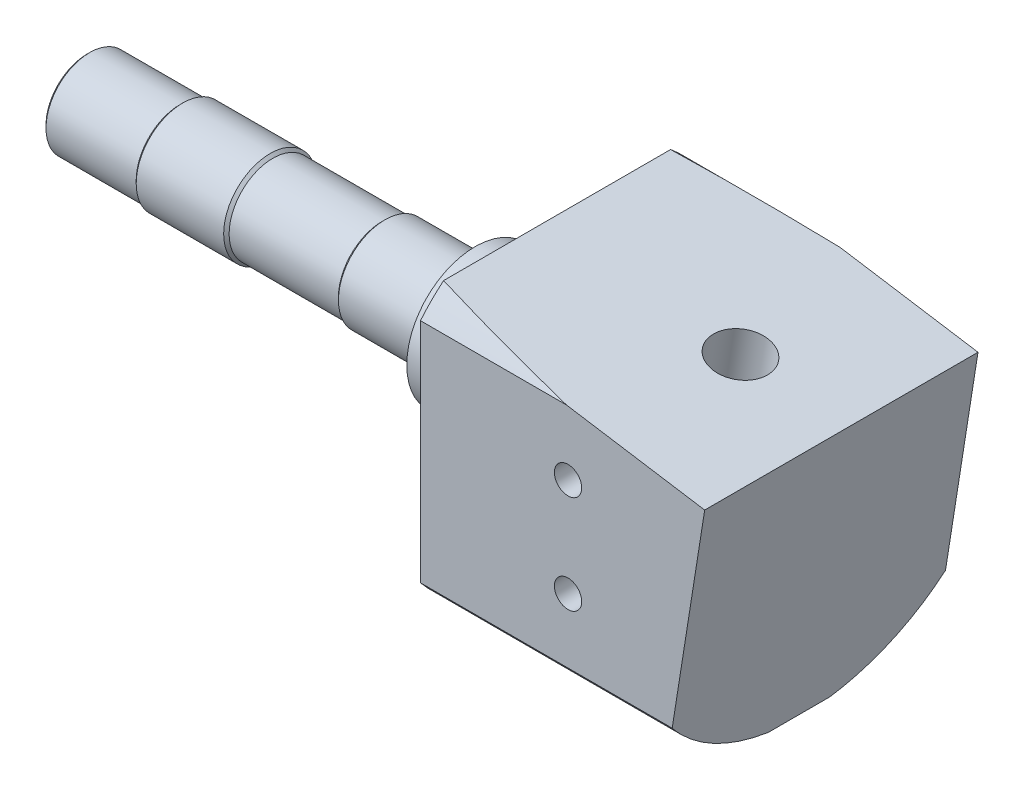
ISO-10303-21;
HEADER;
FILE_DESCRIPTION(('STEP AP214'),'2;1');
FILE_NAME('part.step','',(''),(''),'','','');
FILE_SCHEMA(('AUTOMOTIVE_DESIGN { 1 0 10303 214 1 1 1 1 }'));
ENDSEC;
DATA;
#1=APPLICATION_CONTEXT('core data for automotive mechanical design processes');
#2=APPLICATION_PROTOCOL_DEFINITION('international standard','automotive_design',2000,#1);
#3=PRODUCT_CONTEXT('',#1,'mechanical');
#4=PRODUCT('Part','Part','',(#3));
#5=PRODUCT_RELATED_PRODUCT_CATEGORY('part','',(#4));
#6=PRODUCT_DEFINITION_FORMATION('','',#4);
#7=PRODUCT_DEFINITION_CONTEXT('part definition',#1,'design');
#8=PRODUCT_DEFINITION('design','',#6,#7);
#9=PRODUCT_DEFINITION_SHAPE('','',#8);
#10=(LENGTH_UNIT() NAMED_UNIT(*) SI_UNIT(.MILLI.,.METRE.));
#11=(NAMED_UNIT(*) PLANE_ANGLE_UNIT() SI_UNIT($,.RADIAN.));
#12=(NAMED_UNIT(*) SI_UNIT($,.STERADIAN.) SOLID_ANGLE_UNIT());
#13=UNCERTAINTY_MEASURE_WITH_UNIT(LENGTH_MEASURE(1.E-05),#10,'distance_accuracy_value','');
#14=(GEOMETRIC_REPRESENTATION_CONTEXT(3) GLOBAL_UNCERTAINTY_ASSIGNED_CONTEXT((#13)) GLOBAL_UNIT_ASSIGNED_CONTEXT((#10,
#11,#12)) REPRESENTATION_CONTEXT('',''));
#15=CARTESIAN_POINT('',(0.,0.,0.));
#16=DIRECTION('',(0.,0.,1.));
#17=DIRECTION('',(1.,0.,0.));
#18=AXIS2_PLACEMENT_3D('',#15,#16,#17);
#19=CARTESIAN_POINT('',(86.,25.,25.));
#20=DIRECTION('',(1.,0.,0.));
#21=DIRECTION('',(0.,1.,0.));
#22=AXIS2_PLACEMENT_3D('',#19,#20,#21);
#23=PLANE('',#22);
#24=CARTESIAN_POINT('',(86.,0.,0.));
#25=DIRECTION('',(1.,0.,0.));
#26=DIRECTION('',(0.,1.,0.));
#27=AXIS2_PLACEMENT_3D('',#24,#25,#26);
#28=CIRCLE('',#27,12.5);
#29=CARTESIAN_POINT('',(86.,12.5,0.));
#30=VERTEX_POINT('',#29);
#31=EDGE_CURVE('E124',#30,#30,#28,.T.);
#32=ORIENTED_EDGE('',*,*,#31,.T.);
#33=EDGE_LOOP('',(#32));
#34=FACE_BOUND('',#33,.T.);
#35=CARTESIAN_POINT('',(86.,0.,0.));
#36=DIRECTION('',(-1.,0.,0.));
#37=DIRECTION('',(0.,-1.,0.));
#38=AXIS2_PLACEMENT_3D('',#35,#36,#37);
#39=CIRCLE('',#38,32.5);
#40=CARTESIAN_POINT('',(86.,20.7665596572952,25.));
#41=VERTEX_POINT('',#40);
#42=CARTESIAN_POINT('',(86.,25.,20.7665596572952));
#43=VERTEX_POINT('',#42);
#44=EDGE_CURVE('E56',#41,#43,#39,.T.);
#45=ORIENTED_EDGE('',*,*,#44,.T.);
#46=DIRECTION('',(0.,0.,-1.));
#47=VECTOR('',#46,1.);
#48=CARTESIAN_POINT('',(86.,25.,25.));
#49=LINE('',#48,#47);
#50=CARTESIAN_POINT('',(86.,25.,-20.7665596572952));
#51=VERTEX_POINT('',#50);
#52=EDGE_CURVE('E121',#43,#51,#49,.T.);
#53=ORIENTED_EDGE('',*,*,#52,.T.);
#54=CARTESIAN_POINT('',(86.,20.7665596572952,-25.));
#55=VERTEX_POINT('',#54);
#56=EDGE_CURVE('E206',#51,#55,#39,.T.);
#57=ORIENTED_EDGE('',*,*,#56,.T.);
#58=DIRECTION('',(0.,-1.,0.));
#59=VECTOR('',#58,1.);
#60=CARTESIAN_POINT('',(86.,25.,-25.));
#61=LINE('',#60,#59);
#62=CARTESIAN_POINT('',(86.,-20.7665596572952,-25.));
#63=VERTEX_POINT('',#62);
#64=EDGE_CURVE('E169',#55,#63,#61,.T.);
#65=ORIENTED_EDGE('',*,*,#64,.T.);
#66=CARTESIAN_POINT('',(86.,-25.,-20.7665596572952));
#67=VERTEX_POINT('',#66);
#68=EDGE_CURVE('E107',#63,#67,#39,.T.);
#69=ORIENTED_EDGE('',*,*,#68,.T.);
#70=DIRECTION('',(0.,0.,-1.));
#71=VECTOR('',#70,1.);
#72=CARTESIAN_POINT('',(86.,-25.,25.));
#73=LINE('',#72,#71);
#74=CARTESIAN_POINT('',(86.,-25.,20.7665596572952));
#75=VERTEX_POINT('',#74);
#76=EDGE_CURVE('E113',#75,#67,#73,.T.);
#77=ORIENTED_EDGE('',*,*,#76,.F.);
#78=CARTESIAN_POINT('',(86.,-20.7665596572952,25.));
#79=VERTEX_POINT('',#78);
#80=EDGE_CURVE('E96',#75,#79,#39,.T.);
#81=ORIENTED_EDGE('',*,*,#80,.T.);
#82=DIRECTION('',(0.,-1.,0.));
#83=VECTOR('',#82,1.);
#84=CARTESIAN_POINT('',(86.,25.,25.));
#85=LINE('',#84,#83);
#86=EDGE_CURVE('E189',#41,#79,#85,.T.);
#87=ORIENTED_EDGE('',*,*,#86,.F.);
#88=EDGE_LOOP('',(#45,#53,#57,#65,#69,#77,#81,#87));
#89=FACE_BOUND('',#88,.T.);
#90=ADVANCED_FACE('F32',(#34,#89),#23,.F.);
#91=CARTESIAN_POINT('',(86.,25.,25.));
#92=DIRECTION('',(-0.156434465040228,-0.987688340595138,0.));
#93=DIRECTION('',(0.987688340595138,-0.156434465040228,0.));
#94=AXIS2_PLACEMENT_3D('',#91,#92,#93);
#95=PLANE('',#94);
#96=CARTESIAN_POINT('',(119.551441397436,19.6859737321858,0.));
#97=DIRECTION('',(0.156434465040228,0.987688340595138,0.));
#98=DIRECTION('',(-0.987688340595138,0.156434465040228,0.));
#99=AXIS2_PLACEMENT_3D('',#96,#97,#98);
#100=CIRCLE('',#99,4.99999999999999);
#101=CARTESIAN_POINT('',(114.61299969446,20.4681460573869,0.));
#102=VERTEX_POINT('',#101);
#103=EDGE_CURVE('E208',#102,#102,#100,.T.);
#104=ORIENTED_EDGE('',*,*,#103,.F.);
#105=EDGE_LOOP('',(#104));
#106=FACE_BOUND('',#105,.T.);
#107=CARTESIAN_POINT('',(243.843787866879,0.,0.));
#108=DIRECTION('',(-0.156434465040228,-0.987688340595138,0.));
#109=DIRECTION('',(-0.987688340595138,0.156434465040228,0.));
#110=AXIS2_PLACEMENT_3D('',#107,#108,#109);
#111=ELLIPSE('',#110,207.754729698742,32.5);
#112=CARTESIAN_POINT('',(112.728890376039,20.7665596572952,-25.));
#113=VERTEX_POINT('',#112);
#114=EDGE_CURVE('E105',#51,#113,#111,.T.);
#115=ORIENTED_EDGE('',*,*,#114,.F.);
#116=ORIENTED_EDGE('',*,*,#52,.F.);
#117=CARTESIAN_POINT('',(112.728890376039,20.7665596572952,25.));
#118=VERTEX_POINT('',#117);
#119=EDGE_CURVE('E199',#118,#43,#111,.T.);
#120=ORIENTED_EDGE('',*,*,#119,.F.);
#121=DIRECTION('',(-0.987688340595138,0.156434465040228,0.));
#122=VECTOR('',#121,1.);
#123=CARTESIAN_POINT('',(86.,25.,25.));
#124=LINE('',#123,#122);
#125=CARTESIAN_POINT('',(138.,16.7640091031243,25.));
#126=VERTEX_POINT('',#125);
#127=EDGE_CURVE('E186',#126,#118,#124,.T.);
#128=ORIENTED_EDGE('',*,*,#127,.F.);
#129=DIRECTION('',(0.,0.,-1.));
#130=VECTOR('',#129,1.);
#131=CARTESIAN_POINT('',(138.,16.7640091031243,25.));
#132=LINE('',#131,#130);
#133=CARTESIAN_POINT('',(138.,16.7640091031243,-25.));
#134=VERTEX_POINT('',#133);
#135=EDGE_CURVE('E126',#126,#134,#132,.T.);
#136=ORIENTED_EDGE('',*,*,#135,.T.);
#137=DIRECTION('',(-0.987688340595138,0.156434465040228,0.));
#138=VECTOR('',#137,1.);
#139=CARTESIAN_POINT('',(86.,25.,-25.));
#140=LINE('',#139,#138);
#141=EDGE_CURVE('E116',#134,#113,#140,.T.);
#142=ORIENTED_EDGE('',*,*,#141,.T.);
#143=EDGE_LOOP('',(#115,#116,#120,#128,#136,#142));
#144=FACE_BOUND('',#143,.T.);
#145=ADVANCED_FACE('F175',(#106,#144),#95,.F.);
#146=CARTESIAN_POINT('',(86.,-25.,25.));
#147=DIRECTION('',(0.156434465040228,0.987688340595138,0.));
#148=DIRECTION('',(-0.987688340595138,0.156434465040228,0.));
#149=AXIS2_PLACEMENT_3D('',#146,#147,#148);
#150=PLANE('',#149);
#151=CARTESIAN_POINT('',(111.826016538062,-29.0904391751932,0.));
#152=DIRECTION('',(0.156434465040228,0.987688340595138,0.));
#153=DIRECTION('',(-0.987688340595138,0.156434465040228,0.));
#154=AXIS2_PLACEMENT_3D('',#151,#152,#153);
#155=CIRCLE('',#154,4.99999999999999);
#156=CARTESIAN_POINT('',(106.887574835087,-28.308266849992,0.));
#157=VERTEX_POINT('',#156);
#158=EDGE_CURVE('E36',#157,#157,#155,.T.);
#159=ORIENTED_EDGE('',*,*,#158,.T.);
#160=EDGE_LOOP('',(#159));
#161=FACE_BOUND('',#160,.T.);
#162=CARTESIAN_POINT('',(-71.8437878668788,0.,0.));
#163=DIRECTION('',(0.156434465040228,0.987688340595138,0.));
#164=DIRECTION('',(-0.987688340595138,0.156434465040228,0.));
#165=AXIS2_PLACEMENT_3D('',#162,#163,#164);
#166=ELLIPSE('',#165,207.754729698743,32.5);
#167=CARTESIAN_POINT('',(130.274575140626,-32.0124038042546,5.60856511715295));
#168=VERTEX_POINT('',#167);
#169=EDGE_CURVE('E99',#75,#168,#166,.T.);
#170=ORIENTED_EDGE('',*,*,#169,.F.);
#171=ORIENTED_EDGE('',*,*,#76,.T.);
#172=CARTESIAN_POINT('',(130.274575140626,-32.0124038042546,-5.60856511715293));
#173=VERTEX_POINT('',#172);
#174=EDGE_CURVE('E118',#173,#67,#166,.T.);
#175=ORIENTED_EDGE('',*,*,#174,.F.);
#176=DIRECTION('',(0.,0.,-1.));
#177=VECTOR('',#176,1.);
#178=CARTESIAN_POINT('',(130.274575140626,-32.0124038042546,25.));
#179=LINE('',#178,#177);
#180=EDGE_CURVE('E115',#168,#173,#179,.T.);
#181=ORIENTED_EDGE('',*,*,#180,.F.);
#182=EDGE_LOOP('',(#170,#171,#175,#181));
#183=FACE_BOUND('',#182,.T.);
#184=ADVANCED_FACE('F111',(#161,#183),#150,.F.);
#185=CARTESIAN_POINT('',(138.,16.7640091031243,25.));
#186=DIRECTION('',(-0.987688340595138,0.156434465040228,0.));
#187=DIRECTION('',(-0.156434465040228,-0.987688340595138,0.));
#188=AXIS2_PLACEMENT_3D('',#185,#186,#187);
#189=PLANE('',#188);
#190=CARTESIAN_POINT('',(135.344841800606,0.,0.));
#191=DIRECTION('',(-0.987688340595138,0.156434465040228,0.));
#192=DIRECTION('',(-0.156434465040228,-0.987688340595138,0.));
#193=AXIS2_PLACEMENT_3D('',#190,#191,#192);
#194=ELLIPSE('',#193,32.9051165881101,32.5);
#195=CARTESIAN_POINT('',(132.05574187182,-20.7665596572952,25.));
#196=VERTEX_POINT('',#195);
#197=EDGE_CURVE('E48',#168,#196,#194,.T.);
#198=ORIENTED_EDGE('',*,*,#197,.F.);
#199=ORIENTED_EDGE('',*,*,#180,.T.);
#200=CARTESIAN_POINT('',(132.05574187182,-20.7665596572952,-25.));
#201=VERTEX_POINT('',#200);
#202=EDGE_CURVE('E203',#201,#173,#194,.T.);
#203=ORIENTED_EDGE('',*,*,#202,.F.);
#204=DIRECTION('',(0.156434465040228,0.987688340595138,0.));
#205=VECTOR('',#204,1.);
#206=CARTESIAN_POINT('',(138.,16.7640091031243,-25.));
#207=LINE('',#206,#205);
#208=EDGE_CURVE('E180',#201,#134,#207,.T.);
#209=ORIENTED_EDGE('',*,*,#208,.T.);
#210=ORIENTED_EDGE('',*,*,#135,.F.);
#211=DIRECTION('',(0.156434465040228,0.987688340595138,0.));
#212=VECTOR('',#211,1.);
#213=CARTESIAN_POINT('',(138.,16.7640091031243,25.));
#214=LINE('',#213,#212);
#215=EDGE_CURVE('E191',#196,#126,#214,.T.);
#216=ORIENTED_EDGE('',*,*,#215,.F.);
#217=EDGE_LOOP('',(#198,#199,#203,#209,#210,#216));
#218=FACE_BOUND('',#217,.T.);
#219=ADVANCED_FACE('F196',(#218),#189,.F.);
#220=CARTESIAN_POINT('',(138.,16.7640091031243,25.));
#221=DIRECTION('',(0.,0.,-1.));
#222=DIRECTION('',(-1.,0.,0.));
#223=AXIS2_PLACEMENT_3D('',#220,#221,#222);
#224=PLANE('',#223);
#225=CARTESIAN_POINT('',(113.,-9.,25.));
#226=DIRECTION('',(0.,0.,1.));
#227=DIRECTION('',(1.,0.,0.));
#228=AXIS2_PLACEMENT_3D('',#225,#226,#227);
#229=CIRCLE('',#228,2.5);
#230=CARTESIAN_POINT('',(115.5,-9.,25.));
#231=VERTEX_POINT('',#230);
#232=EDGE_CURVE('E220',#231,#231,#229,.T.);
#233=ORIENTED_EDGE('',*,*,#232,.F.);
#234=EDGE_LOOP('',(#233));
#235=FACE_BOUND('',#234,.T.);
#236=CARTESIAN_POINT('',(113.,9.,25.));
#237=DIRECTION('',(0.,0.,1.));
#238=DIRECTION('',(1.,0.,0.));
#239=AXIS2_PLACEMENT_3D('',#236,#237,#238);
#240=CIRCLE('',#239,2.5);
#241=CARTESIAN_POINT('',(115.5,9.,25.));
#242=VERTEX_POINT('',#241);
#243=EDGE_CURVE('E214',#242,#242,#240,.T.);
#244=ORIENTED_EDGE('',*,*,#243,.F.);
#245=EDGE_LOOP('',(#244));
#246=FACE_BOUND('',#245,.T.);
#247=DIRECTION('',(-1.,0.,0.));
#248=VECTOR('',#247,1.);
#249=CARTESIAN_POINT('',(138.,-20.7665596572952,25.));
#250=LINE('',#249,#248);
#251=EDGE_CURVE('E100',#196,#79,#250,.T.);
#252=ORIENTED_EDGE('',*,*,#251,.F.);
#253=ORIENTED_EDGE('',*,*,#215,.T.);
#254=ORIENTED_EDGE('',*,*,#127,.T.);
#255=DIRECTION('',(-1.,0.,0.));
#256=VECTOR('',#255,1.);
#257=CARTESIAN_POINT('',(138.,20.7665596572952,25.));
#258=LINE('',#257,#256);
#259=EDGE_CURVE('E200',#41,#118,#258,.F.);
#260=ORIENTED_EDGE('',*,*,#259,.F.);
#261=ORIENTED_EDGE('',*,*,#86,.T.);
#262=EDGE_LOOP('',(#252,#253,#254,#260,#261));
#263=FACE_BOUND('',#262,.T.);
#264=ADVANCED_FACE('F194',(#235,#246,#263),#224,.F.);
#265=CARTESIAN_POINT('',(138.,16.7640091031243,-25.));
#266=DIRECTION('',(0.,0.,-1.));
#267=DIRECTION('',(-1.,0.,0.));
#268=AXIS2_PLACEMENT_3D('',#265,#266,#267);
#269=PLANE('',#268);
#270=ORIENTED_EDGE('',*,*,#208,.F.);
#271=DIRECTION('',(-1.,0.,0.));
#272=VECTOR('',#271,1.);
#273=CARTESIAN_POINT('',(138.,-20.7665596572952,-25.));
#274=LINE('',#273,#272);
#275=EDGE_CURVE('E11',#201,#63,#274,.T.);
#276=ORIENTED_EDGE('',*,*,#275,.T.);
#277=ORIENTED_EDGE('',*,*,#64,.F.);
#278=DIRECTION('',(-1.,0.,0.));
#279=VECTOR('',#278,1.);
#280=CARTESIAN_POINT('',(138.,20.7665596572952,-25.));
#281=LINE('',#280,#279);
#282=EDGE_CURVE('E41',#55,#113,#281,.F.);
#283=ORIENTED_EDGE('',*,*,#282,.T.);
#284=ORIENTED_EDGE('',*,*,#141,.F.);
#285=EDGE_LOOP('',(#270,#276,#277,#283,#284));
#286=FACE_BOUND('',#285,.T.);
#287=ADVANCED_FACE('F168',(#286),#269,.T.);
#288=CARTESIAN_POINT('',(0.,0.,0.));
#289=DIRECTION('',(1.,0.,0.));
#290=DIRECTION('',(0.,0.,-1.));
#291=AXIS2_PLACEMENT_3D('',#288,#289,#290);
#292=PLANE('',#291);
#293=CARTESIAN_POINT('',(0.,0.,0.));
#294=DIRECTION('',(1.,0.,0.));
#295=DIRECTION('',(0.,0.,-1.));
#296=AXIS2_PLACEMENT_3D('',#293,#294,#295);
#297=CIRCLE('',#296,7.5);
#298=CARTESIAN_POINT('',(0.,0.,-7.5));
#299=VERTEX_POINT('',#298);
#300=EDGE_CURVE('E147',#299,#299,#297,.F.);
#301=ORIENTED_EDGE('',*,*,#300,.T.);
#302=EDGE_LOOP('',(#301));
#303=FACE_BOUND('',#302,.T.);
#304=ADVANCED_FACE('F34',(#303),#292,.F.);
#305=CARTESIAN_POINT('',(-24.7781284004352,0.,0.));
#306=DIRECTION('',(-1.,0.,0.));
#307=DIRECTION('',(0.,0.,1.));
#308=AXIS2_PLACEMENT_3D('',#305,#306,#307);
#309=CYLINDRICAL_SURFACE('',#308,8.);
#310=CARTESIAN_POINT('',(0.5,0.,0.));
#311=DIRECTION('',(1.,0.,0.));
#312=DIRECTION('',(0.,0.,-1.));
#313=AXIS2_PLACEMENT_3D('',#310,#311,#312);
#314=CIRCLE('',#313,8.);
#315=CARTESIAN_POINT('',(0.5,0.,-8.));
#316=VERTEX_POINT('',#315);
#317=EDGE_CURVE('E150',#316,#316,#314,.T.);
#318=ORIENTED_EDGE('',*,*,#317,.T.);
#319=EDGE_LOOP('',(#318));
#320=FACE_BOUND('',#319,.T.);
#321=CARTESIAN_POINT('',(17.,0.,0.));
#322=DIRECTION('',(-1.,0.,0.));
#323=DIRECTION('',(0.,0.,1.));
#324=AXIS2_PLACEMENT_3D('',#321,#322,#323);
#325=CIRCLE('',#324,8.);
#326=CARTESIAN_POINT('',(17.,0.,8.));
#327=VERTEX_POINT('',#326);
#328=EDGE_CURVE('E144',#327,#327,#325,.T.);
#329=ORIENTED_EDGE('',*,*,#328,.T.);
#330=EDGE_LOOP('',(#329));
#331=FACE_BOUND('',#330,.T.);
#332=ADVANCED_FACE('F292',(#320,#331),#309,.T.);
#333=CARTESIAN_POINT('',(-24.7781284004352,0.,0.));
#334=DIRECTION('',(-1.,0.,0.));
#335=DIRECTION('',(0.,0.,1.));
#336=AXIS2_PLACEMENT_3D('',#333,#334,#335);
#337=CYLINDRICAL_SURFACE('',#336,8.5);
#338=CARTESIAN_POINT('',(17.5,0.,0.));
#339=DIRECTION('',(1.,0.,0.));
#340=DIRECTION('',(0.,0.,-1.));
#341=AXIS2_PLACEMENT_3D('',#338,#339,#340);
#342=CIRCLE('',#341,8.5);
#343=CARTESIAN_POINT('',(17.5,0.,-8.5));
#344=VERTEX_POINT('',#343);
#345=EDGE_CURVE('E156',#344,#344,#342,.T.);
#346=ORIENTED_EDGE('',*,*,#345,.T.);
#347=EDGE_LOOP('',(#346));
#348=FACE_BOUND('',#347,.T.);
#349=CARTESIAN_POINT('',(33.5,0.,0.));
#350=DIRECTION('',(-1.,0.,0.));
#351=DIRECTION('',(0.,0.,1.));
#352=AXIS2_PLACEMENT_3D('',#349,#350,#351);
#353=CIRCLE('',#352,8.5);
#354=CARTESIAN_POINT('',(33.5,0.,8.5));
#355=VERTEX_POINT('',#354);
#356=EDGE_CURVE('E153',#355,#355,#353,.T.);
#357=ORIENTED_EDGE('',*,*,#356,.T.);
#358=EDGE_LOOP('',(#357));
#359=FACE_BOUND('',#358,.T.);
#360=ADVANCED_FACE('F289',(#348,#359),#337,.T.);
#361=CARTESIAN_POINT('',(-24.7781284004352,0.,0.));
#362=DIRECTION('',(-1.,0.,0.));
#363=DIRECTION('',(0.,0.,1.));
#364=AXIS2_PLACEMENT_3D('',#361,#362,#363);
#365=CYLINDRICAL_SURFACE('',#364,8.);
#366=CARTESIAN_POINT('',(34.,0.,0.));
#367=DIRECTION('',(-1.,0.,0.));
#368=DIRECTION('',(0.,0.,1.));
#369=AXIS2_PLACEMENT_3D('',#366,#367,#368);
#370=CIRCLE('',#369,8.);
#371=CARTESIAN_POINT('',(34.,0.,8.));
#372=VERTEX_POINT('',#371);
#373=EDGE_CURVE('E141',#372,#372,#370,.T.);
#374=ORIENTED_EDGE('',*,*,#373,.F.);
#375=EDGE_LOOP('',(#374));
#376=FACE_BOUND('',#375,.T.);
#377=CARTESIAN_POINT('',(54.,0.,0.));
#378=DIRECTION('',(-1.,0.,0.));
#379=DIRECTION('',(0.,0.,1.));
#380=AXIS2_PLACEMENT_3D('',#377,#378,#379);
#381=CIRCLE('',#380,8.);
#382=CARTESIAN_POINT('',(54.,0.,8.));
#383=VERTEX_POINT('',#382);
#384=EDGE_CURVE('E138',#383,#383,#381,.T.);
#385=ORIENTED_EDGE('',*,*,#384,.T.);
#386=EDGE_LOOP('',(#385));
#387=FACE_BOUND('',#386,.T.);
#388=ADVANCED_FACE('F285',(#376,#387),#365,.T.);
#389=CARTESIAN_POINT('',(-24.7781284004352,0.,0.));
#390=DIRECTION('',(-1.,0.,0.));
#391=DIRECTION('',(0.,0.,1.));
#392=AXIS2_PLACEMENT_3D('',#389,#390,#391);
#393=CYLINDRICAL_SURFACE('',#392,8.5);
#394=CARTESIAN_POINT('',(54.5,0.,0.));
#395=DIRECTION('',(1.,0.,0.));
#396=DIRECTION('',(0.,0.,-1.));
#397=AXIS2_PLACEMENT_3D('',#394,#395,#396);
#398=CIRCLE('',#397,8.5);
#399=CARTESIAN_POINT('',(54.5,0.,-8.5));
#400=VERTEX_POINT('',#399);
#401=EDGE_CURVE('E159',#400,#400,#398,.T.);
#402=ORIENTED_EDGE('',*,*,#401,.T.);
#403=EDGE_LOOP('',(#402));
#404=FACE_BOUND('',#403,.T.);
#405=CARTESIAN_POINT('',(71.,0.,0.));
#406=DIRECTION('',(-1.,0.,0.));
#407=DIRECTION('',(0.,0.,1.));
#408=AXIS2_PLACEMENT_3D('',#405,#406,#407);
#409=CIRCLE('',#408,8.5);
#410=CARTESIAN_POINT('',(71.,0.,8.5));
#411=VERTEX_POINT('',#410);
#412=EDGE_CURVE('E135',#411,#411,#409,.T.);
#413=ORIENTED_EDGE('',*,*,#412,.T.);
#414=EDGE_LOOP('',(#413));
#415=FACE_BOUND('',#414,.T.);
#416=ADVANCED_FACE('F281',(#404,#415),#393,.T.);
#417=CARTESIAN_POINT('',(71.,8.5,0.));
#418=DIRECTION('',(1.,0.,0.));
#419=DIRECTION('',(0.,0.,-1.));
#420=AXIS2_PLACEMENT_3D('',#417,#418,#419);
#421=PLANE('',#420);
#422=ORIENTED_EDGE('',*,*,#412,.F.);
#423=EDGE_LOOP('',(#422));
#424=FACE_BOUND('',#423,.T.);
#425=CARTESIAN_POINT('',(71.,0.,0.));
#426=DIRECTION('',(-1.,0.,0.));
#427=DIRECTION('',(0.,0.,1.));
#428=AXIS2_PLACEMENT_3D('',#425,#426,#427);
#429=CIRCLE('',#428,12.5);
#430=CARTESIAN_POINT('',(71.,0.,12.5));
#431=VERTEX_POINT('',#430);
#432=EDGE_CURVE('E132',#431,#431,#429,.T.);
#433=ORIENTED_EDGE('',*,*,#432,.T.);
#434=EDGE_LOOP('',(#433));
#435=FACE_BOUND('',#434,.T.);
#436=ADVANCED_FACE('F277',(#424,#435),#421,.F.);
#437=CARTESIAN_POINT('',(-24.7781284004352,0.,0.));
#438=DIRECTION('',(-1.,0.,0.));
#439=DIRECTION('',(0.,0.,1.));
#440=AXIS2_PLACEMENT_3D('',#437,#438,#439);
#441=CYLINDRICAL_SURFACE('',#440,12.5);
#442=ORIENTED_EDGE('',*,*,#432,.F.);
#443=EDGE_LOOP('',(#442));
#444=FACE_BOUND('',#443,.T.);
#445=ORIENTED_EDGE('',*,*,#31,.F.);
#446=EDGE_LOOP('',(#445));
#447=FACE_BOUND('',#446,.T.);
#448=ADVANCED_FACE('F273',(#444,#447),#441,.T.);
#449=CARTESIAN_POINT('',(0.,0.,0.));
#450=DIRECTION('',(1.,0.,0.));
#451=DIRECTION('',(0.,0.,-1.));
#452=AXIS2_PLACEMENT_3D('',#449,#450,#451);
#453=CONICAL_SURFACE('',#452,7.5,0.785398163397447);
#454=ORIENTED_EDGE('',*,*,#317,.F.);
#455=EDGE_LOOP('',(#454));
#456=FACE_BOUND('',#455,.T.);
#457=ORIENTED_EDGE('',*,*,#300,.F.);
#458=EDGE_LOOP('',(#457));
#459=FACE_BOUND('',#458,.T.);
#460=ADVANCED_FACE('F269',(#456,#459),#453,.T.);
#461=CARTESIAN_POINT('',(17.,0.,0.));
#462=DIRECTION('',(1.,0.,0.));
#463=DIRECTION('',(0.,0.,-1.));
#464=AXIS2_PLACEMENT_3D('',#461,#462,#463);
#465=CONICAL_SURFACE('',#464,8.00000000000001,0.78539816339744);
#466=ORIENTED_EDGE('',*,*,#345,.F.);
#467=EDGE_LOOP('',(#466));
#468=FACE_BOUND('',#467,.T.);
#469=ORIENTED_EDGE('',*,*,#328,.F.);
#470=EDGE_LOOP('',(#469));
#471=FACE_BOUND('',#470,.T.);
#472=ADVANCED_FACE('F265',(#468,#471),#465,.T.);
#473=CARTESIAN_POINT('',(33.5,0.,0.));
#474=DIRECTION('',(-1.,0.,0.));
#475=DIRECTION('',(0.,0.,1.));
#476=AXIS2_PLACEMENT_3D('',#473,#474,#475);
#477=CONICAL_SURFACE('',#476,8.5,0.785398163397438);
#478=ORIENTED_EDGE('',*,*,#373,.T.);
#479=EDGE_LOOP('',(#478));
#480=FACE_BOUND('',#479,.T.);
#481=ORIENTED_EDGE('',*,*,#356,.F.);
#482=EDGE_LOOP('',(#481));
#483=FACE_BOUND('',#482,.T.);
#484=ADVANCED_FACE('F261',(#480,#483),#477,.T.);
#485=CARTESIAN_POINT('',(54.,0.,0.));
#486=DIRECTION('',(1.,0.,0.));
#487=DIRECTION('',(0.,0.,-1.));
#488=AXIS2_PLACEMENT_3D('',#485,#486,#487);
#489=CONICAL_SURFACE('',#488,8.00000000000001,0.785398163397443);
#490=ORIENTED_EDGE('',*,*,#401,.F.);
#491=EDGE_LOOP('',(#490));
#492=FACE_BOUND('',#491,.T.);
#493=ORIENTED_EDGE('',*,*,#384,.F.);
#494=EDGE_LOOP('',(#493));
#495=FACE_BOUND('',#494,.T.);
#496=ADVANCED_FACE('F257',(#492,#495),#489,.T.);
#497=CARTESIAN_POINT('',(138.,0.,0.));
#498=DIRECTION('',(-1.,0.,0.));
#499=DIRECTION('',(0.,-1.,0.));
#500=AXIS2_PLACEMENT_3D('',#497,#498,#499);
#501=CYLINDRICAL_SURFACE('',#500,32.5);
#502=ORIENTED_EDGE('',*,*,#114,.T.);
#503=ORIENTED_EDGE('',*,*,#282,.F.);
#504=ORIENTED_EDGE('',*,*,#56,.F.);
#505=EDGE_LOOP('',(#502,#503,#504));
#506=FACE_BOUND('',#505,.T.);
#507=ADVANCED_FACE('F260',(#506),#501,.T.);
#508=ORIENTED_EDGE('',*,*,#174,.T.);
#509=ORIENTED_EDGE('',*,*,#68,.F.);
#510=ORIENTED_EDGE('',*,*,#275,.F.);
#511=ORIENTED_EDGE('',*,*,#202,.T.);
#512=EDGE_LOOP('',(#508,#509,#510,#511));
#513=FACE_BOUND('',#512,.T.);
#514=ADVANCED_FACE('F205',(#513),#501,.T.);
#515=ORIENTED_EDGE('',*,*,#119,.T.);
#516=ORIENTED_EDGE('',*,*,#44,.F.);
#517=ORIENTED_EDGE('',*,*,#259,.T.);
#518=EDGE_LOOP('',(#515,#516,#517));
#519=FACE_BOUND('',#518,.T.);
#520=ADVANCED_FACE('F342',(#519),#501,.T.);
#521=ORIENTED_EDGE('',*,*,#169,.T.);
#522=ORIENTED_EDGE('',*,*,#197,.T.);
#523=ORIENTED_EDGE('',*,*,#251,.T.);
#524=ORIENTED_EDGE('',*,*,#80,.F.);
#525=EDGE_LOOP('',(#521,#522,#523,#524));
#526=FACE_BOUND('',#525,.T.);
#527=ADVANCED_FACE('F98',(#526),#501,.T.);
#528=CARTESIAN_POINT('',(108.637970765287,-49.2189680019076,0.));
#529=DIRECTION('',(0.156434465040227,0.987688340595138,0.));
#530=DIRECTION('',(-0.987688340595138,0.156434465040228,0.));
#531=AXIS2_PLACEMENT_3D('',#528,#529,#530);
#532=CYLINDRICAL_SURFACE('',#531,4.99999999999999);
#533=ORIENTED_EDGE('',*,*,#103,.T.);
#534=EDGE_LOOP('',(#533));
#535=FACE_BOUND('',#534,.T.);
#536=ORIENTED_EDGE('',*,*,#158,.F.);
#537=EDGE_LOOP('',(#536));
#538=FACE_BOUND('',#537,.T.);
#539=ADVANCED_FACE('F234',(#535,#538),#532,.F.);
#540=CARTESIAN_POINT('',(113.,9.,7.));
#541=DIRECTION('',(0.,0.,1.));
#542=DIRECTION('',(1.,0.,0.));
#543=AXIS2_PLACEMENT_3D('',#540,#541,#542);
#544=CYLINDRICAL_SURFACE('',#543,2.5);
#545=CARTESIAN_POINT('',(113.,9.,7.));
#546=DIRECTION('',(0.,0.,1.));
#547=DIRECTION('',(1.,0.,0.));
#548=AXIS2_PLACEMENT_3D('',#545,#546,#547);
#549=CIRCLE('',#548,2.5);
#550=CARTESIAN_POINT('',(115.5,9.,7.));
#551=VERTEX_POINT('',#550);
#552=EDGE_CURVE('E211',#551,#551,#549,.T.);
#553=ORIENTED_EDGE('',*,*,#552,.F.);
#554=EDGE_LOOP('',(#553));
#555=FACE_BOUND('',#554,.T.);
#556=ORIENTED_EDGE('',*,*,#243,.T.);
#557=EDGE_LOOP('',(#556));
#558=FACE_BOUND('',#557,.T.);
#559=ADVANCED_FACE('F231',(#555,#558),#544,.F.);
#560=CARTESIAN_POINT('',(113.,9.,7.));
#561=DIRECTION('',(0.,0.,1.));
#562=DIRECTION('',(1.,0.,0.));
#563=AXIS2_PLACEMENT_3D('',#560,#561,#562);
#564=PLANE('',#563);
#565=ORIENTED_EDGE('',*,*,#552,.T.);
#566=EDGE_LOOP('',(#565));
#567=FACE_BOUND('',#566,.T.);
#568=ADVANCED_FACE('F233',(#567),#564,.T.);
#569=CARTESIAN_POINT('',(113.,-9.,7.));
#570=DIRECTION('',(0.,0.,1.));
#571=DIRECTION('',(1.,0.,0.));
#572=AXIS2_PLACEMENT_3D('',#569,#570,#571);
#573=CYLINDRICAL_SURFACE('',#572,2.5);
#574=CARTESIAN_POINT('',(113.,-9.,7.));
#575=DIRECTION('',(0.,0.,1.));
#576=DIRECTION('',(1.,0.,0.));
#577=AXIS2_PLACEMENT_3D('',#574,#575,#576);
#578=CIRCLE('',#577,2.5);
#579=CARTESIAN_POINT('',(115.5,-9.,7.));
#580=VERTEX_POINT('',#579);
#581=EDGE_CURVE('E217',#580,#580,#578,.T.);
#582=ORIENTED_EDGE('',*,*,#581,.F.);
#583=EDGE_LOOP('',(#582));
#584=FACE_BOUND('',#583,.T.);
#585=ORIENTED_EDGE('',*,*,#232,.T.);
#586=EDGE_LOOP('',(#585));
#587=FACE_BOUND('',#586,.T.);
#588=ADVANCED_FACE('F224',(#584,#587),#573,.F.);
#589=CARTESIAN_POINT('',(113.,-9.,7.));
#590=DIRECTION('',(0.,0.,1.));
#591=DIRECTION('',(1.,0.,0.));
#592=AXIS2_PLACEMENT_3D('',#589,#590,#591);
#593=PLANE('',#592);
#594=ORIENTED_EDGE('',*,*,#581,.T.);
#595=EDGE_LOOP('',(#594));
#596=FACE_BOUND('',#595,.T.);
#597=ADVANCED_FACE('F366',(#596),#593,.T.);
#598=CLOSED_SHELL('',(#90,#145,#184,#219,#264,#287,#304,#332,#360,#388,#416,#436,#448,#460,#472,
#484,#496,#507,#514,#520,#527,#539,#559,#568,#588,#597));
#599=MANIFOLD_SOLID_BREP('B2',#598);
#600=ADVANCED_BREP_SHAPE_REPRESENTATION('',(#18,#599),#14);
#601=SHAPE_DEFINITION_REPRESENTATION(#9,#600);
ENDSEC;
END-ISO-10303-21;
